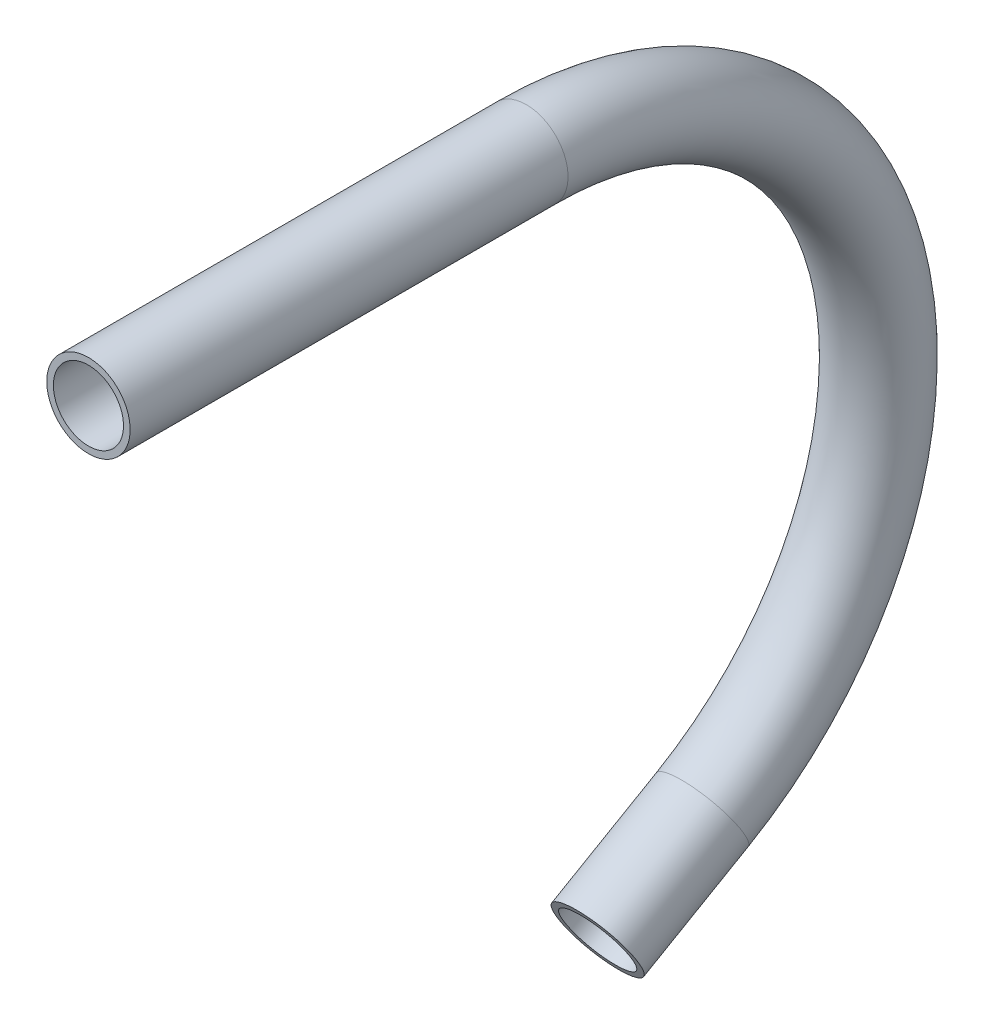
ISO-10303-21;
HEADER;
FILE_DESCRIPTION(('STEP AP214'),'2;1');
FILE_NAME('part.step','',(''),(''),'','','');
FILE_SCHEMA(('AUTOMOTIVE_DESIGN { 1 0 10303 214 1 1 1 1 }'));
ENDSEC;
DATA;
#1=APPLICATION_CONTEXT('core data for automotive mechanical design processes');
#2=APPLICATION_PROTOCOL_DEFINITION('international standard','automotive_design',2000,#1);
#3=PRODUCT_CONTEXT('',#1,'mechanical');
#4=PRODUCT('Part','Part','',(#3));
#5=PRODUCT_RELATED_PRODUCT_CATEGORY('part','',(#4));
#6=PRODUCT_DEFINITION_FORMATION('','',#4);
#7=PRODUCT_DEFINITION_CONTEXT('part definition',#1,'design');
#8=PRODUCT_DEFINITION('design','',#6,#7);
#9=PRODUCT_DEFINITION_SHAPE('','',#8);
#10=(LENGTH_UNIT() NAMED_UNIT(*) SI_UNIT(.MILLI.,.METRE.));
#11=(NAMED_UNIT(*) PLANE_ANGLE_UNIT() SI_UNIT($,.RADIAN.));
#12=(NAMED_UNIT(*) SI_UNIT($,.STERADIAN.) SOLID_ANGLE_UNIT());
#13=UNCERTAINTY_MEASURE_WITH_UNIT(LENGTH_MEASURE(1.E-05),#10,'distance_accuracy_value','');
#14=(GEOMETRIC_REPRESENTATION_CONTEXT(3) GLOBAL_UNCERTAINTY_ASSIGNED_CONTEXT((#13)) GLOBAL_UNIT_ASSIGNED_CONTEXT((#10,
#11,#12)) REPRESENTATION_CONTEXT('',''));
#15=CARTESIAN_POINT('',(0.,0.,0.));
#16=DIRECTION('',(0.,0.,1.));
#17=DIRECTION('',(1.,0.,0.));
#18=AXIS2_PLACEMENT_3D('',#15,#16,#17);
#19=CARTESIAN_POINT('',(0.,-106.706575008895,-329.932581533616));
#20=DIRECTION('',(0.,-0.5,0.866025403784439));
#21=DIRECTION('',(0.,-0.866025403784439,-0.5));
#22=AXIS2_PLACEMENT_3D('',#19,#20,#21);
#23=CYLINDRICAL_SURFACE('',#22,17.25);
#24=CARTESIAN_POINT('',(0.,-106.706575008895,-329.932581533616));
#25=DIRECTION('',(0.,-0.5,0.866025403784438));
#26=DIRECTION('',(-1.,0.,0.));
#27=AXIS2_PLACEMENT_3D('',#24,#25,#26);
#28=CIRCLE('',#27,17.25);
#29=CARTESIAN_POINT('',(0.,-121.645513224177,-338.557581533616));
#30=VERTEX_POINT('',#29);
#31=EDGE_CURVE('E42',#30,#30,#28,.T.);
#32=ORIENTED_EDGE('',*,*,#31,.T.);
#33=EDGE_LOOP('',(#32));
#34=FACE_BOUND('',#33,.T.);
#35=CARTESIAN_POINT('',(0.,-131.706575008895,-286.631311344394));
#36=DIRECTION('',(0.,-0.5,0.866025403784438));
#37=DIRECTION('',(-1.,0.,0.));
#38=AXIS2_PLACEMENT_3D('',#35,#36,#37);
#39=CIRCLE('',#38,17.25);
#40=CARTESIAN_POINT('',(-17.25,-131.706575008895,-286.631311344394));
#41=VERTEX_POINT('',#40);
#42=EDGE_CURVE('E10',#41,#41,#39,.T.);
#43=ORIENTED_EDGE('',*,*,#42,.F.);
#44=EDGE_LOOP('',(#43));
#45=FACE_BOUND('',#44,.T.);
#46=ADVANCED_FACE('F32',(#34,#45),#23,.T.);
#47=CARTESIAN_POINT('',(0.,-106.706575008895,-329.932581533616));
#48=DIRECTION('',(0.,-0.5,0.866025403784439));
#49=DIRECTION('',(0.,-0.866025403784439,-0.5));
#50=AXIS2_PLACEMENT_3D('',#47,#48,#49);
#51=CYLINDRICAL_SURFACE('',#50,14.5);
#52=CARTESIAN_POINT('',(0.,-106.706575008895,-329.932581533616));
#53=DIRECTION('',(0.,-0.5,0.866025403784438));
#54=DIRECTION('',(-1.,0.,0.));
#55=AXIS2_PLACEMENT_3D('',#52,#53,#54);
#56=CIRCLE('',#55,14.5);
#57=CARTESIAN_POINT('',(0.,-119.26394336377,-337.182581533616));
#58=VERTEX_POINT('',#57);
#59=EDGE_CURVE('E46',#58,#58,#56,.T.);
#60=ORIENTED_EDGE('',*,*,#59,.F.);
#61=EDGE_LOOP('',(#60));
#62=FACE_BOUND('',#61,.T.);
#63=CARTESIAN_POINT('',(0.,-131.706575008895,-286.631311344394));
#64=DIRECTION('',(0.,-0.5,0.866025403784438));
#65=DIRECTION('',(-1.,0.,0.));
#66=AXIS2_PLACEMENT_3D('',#63,#64,#65);
#67=CIRCLE('',#66,14.5);
#68=CARTESIAN_POINT('',(-14.5,-131.706575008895,-286.631311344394));
#69=VERTEX_POINT('',#68);
#70=EDGE_CURVE('E38',#69,#69,#67,.T.);
#71=ORIENTED_EDGE('',*,*,#70,.T.);
#72=EDGE_LOOP('',(#71));
#73=FACE_BOUND('',#72,.T.);
#74=ADVANCED_FACE('F74',(#62,#73),#51,.F.);
#75=CARTESIAN_POINT('',(0.,19.3928852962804,-257.129024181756));
#76=DIRECTION('',(-1.,0.,0.));
#77=DIRECTION('',(0.,0.,1.));
#78=AXIS2_PLACEMENT_3D('',#75,#76,#77);
#79=TOROIDAL_SURFACE('',#78,145.60711470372,17.25);
#80=CARTESIAN_POINT('',(0.,165.,-257.129024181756));
#81=DIRECTION('',(0.,0.,-1.));
#82=DIRECTION('',(-1.,0.,0.));
#83=AXIS2_PLACEMENT_3D('',#80,#81,#82);
#84=CIRCLE('',#83,17.25);
#85=CARTESIAN_POINT('',(0.,182.25,-257.129024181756));
#86=VERTEX_POINT('',#85);
#87=EDGE_CURVE('E51',#86,#86,#84,.T.);
#88=CARTESIAN_POINT('',(0.,19.3928852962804,-257.129024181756));
#89=DIRECTION('',(-1.,0.,0.));
#90=DIRECTION('',(0.,0.,1.));
#91=AXIS2_PLACEMENT_3D('',#88,#89,#90);
#92=CIRCLE('',#91,162.85711470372);
#93=EDGE_CURVE('',#86,#30,#92,.T.);
#94=ORIENTED_EDGE('',*,*,#87,.T.);
#95=ORIENTED_EDGE('',*,*,#31,.F.);
#96=ORIENTED_EDGE('',*,*,#93,.T.);
#97=ORIENTED_EDGE('',*,*,#93,.F.);
#98=EDGE_LOOP('',(#94,#96,#95,#97));
#99=FACE_BOUND('',#98,.T.);
#100=ADVANCED_FACE('F70',(#99),#79,.T.);
#101=CARTESIAN_POINT('',(0.,19.3928852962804,-257.129024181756));
#102=DIRECTION('',(-1.,0.,0.));
#103=DIRECTION('',(0.,0.,1.));
#104=AXIS2_PLACEMENT_3D('',#101,#102,#103);
#105=TOROIDAL_SURFACE('',#104,145.60711470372,14.5);
#106=CARTESIAN_POINT('',(0.,165.,-257.129024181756));
#107=DIRECTION('',(0.,0.,-1.));
#108=DIRECTION('',(-1.,0.,0.));
#109=AXIS2_PLACEMENT_3D('',#106,#107,#108);
#110=CIRCLE('',#109,14.5);
#111=CARTESIAN_POINT('',(0.,179.5,-257.129024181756));
#112=VERTEX_POINT('',#111);
#113=EDGE_CURVE('E55',#112,#112,#110,.T.);
#114=CARTESIAN_POINT('',(0.,19.3928852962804,-257.129024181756));
#115=DIRECTION('',(-1.,0.,0.));
#116=DIRECTION('',(0.,0.,1.));
#117=AXIS2_PLACEMENT_3D('',#114,#115,#116);
#118=CIRCLE('',#117,160.10711470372);
#119=EDGE_CURVE('',#112,#58,#118,.T.);
#120=ORIENTED_EDGE('',*,*,#113,.F.);
#121=ORIENTED_EDGE('',*,*,#59,.T.);
#122=ORIENTED_EDGE('',*,*,#119,.T.);
#123=ORIENTED_EDGE('',*,*,#119,.F.);
#124=EDGE_LOOP('',(#120,#122,#121,#123));
#125=FACE_BOUND('',#124,.T.);
#126=ADVANCED_FACE('F67',(#125),#105,.F.);
#127=CARTESIAN_POINT('',(0.,165.,-257.129024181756));
#128=DIRECTION('',(0.,0.,1.));
#129=DIRECTION('',(0.,-1.,0.));
#130=AXIS2_PLACEMENT_3D('',#127,#128,#129);
#131=CYLINDRICAL_SURFACE('',#130,14.5);
#132=ORIENTED_EDGE('',*,*,#113,.T.);
#133=EDGE_LOOP('',(#132));
#134=FACE_BOUND('',#133,.T.);
#135=CARTESIAN_POINT('',(0.,165.,-76.));
#136=DIRECTION('',(0.,0.,-1.));
#137=DIRECTION('',(-1.,0.,0.));
#138=AXIS2_PLACEMENT_3D('',#135,#136,#137);
#139=CIRCLE('',#138,14.5);
#140=CARTESIAN_POINT('',(-14.5,165.,-76.));
#141=VERTEX_POINT('',#140);
#142=EDGE_CURVE('E56',#141,#141,#139,.T.);
#143=ORIENTED_EDGE('',*,*,#142,.F.);
#144=EDGE_LOOP('',(#143));
#145=FACE_BOUND('',#144,.T.);
#146=ADVANCED_FACE('F64',(#134,#145),#131,.F.);
#147=CARTESIAN_POINT('',(0.,165.,-257.129024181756));
#148=DIRECTION('',(0.,0.,1.));
#149=DIRECTION('',(0.,-1.,0.));
#150=AXIS2_PLACEMENT_3D('',#147,#148,#149);
#151=CYLINDRICAL_SURFACE('',#150,17.25);
#152=ORIENTED_EDGE('',*,*,#87,.F.);
#153=EDGE_LOOP('',(#152));
#154=FACE_BOUND('',#153,.T.);
#155=CARTESIAN_POINT('',(0.,165.,-76.));
#156=DIRECTION('',(0.,0.,-1.));
#157=DIRECTION('',(-1.,0.,0.));
#158=AXIS2_PLACEMENT_3D('',#155,#156,#157);
#159=CIRCLE('',#158,17.25);
#160=CARTESIAN_POINT('',(-17.25,165.,-76.));
#161=VERTEX_POINT('',#160);
#162=EDGE_CURVE('E52',#161,#161,#159,.T.);
#163=ORIENTED_EDGE('',*,*,#162,.T.);
#164=EDGE_LOOP('',(#163));
#165=FACE_BOUND('',#164,.T.);
#166=ADVANCED_FACE('F86',(#154,#165),#151,.T.);
#167=CARTESIAN_POINT('',(0.,-131.706575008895,-286.631311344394));
#168=DIRECTION('',(0.,-0.5,0.866025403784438));
#169=DIRECTION('',(-1.,0.,0.));
#170=AXIS2_PLACEMENT_3D('',#167,#168,#169);
#171=PLANE('',#170);
#172=ORIENTED_EDGE('',*,*,#70,.F.);
#173=EDGE_LOOP('',(#172));
#174=FACE_BOUND('',#173,.T.);
#175=ORIENTED_EDGE('',*,*,#42,.T.);
#176=EDGE_LOOP('',(#175));
#177=FACE_BOUND('',#176,.T.);
#178=ADVANCED_FACE('F89',(#174,#177),#171,.T.);
#179=CARTESIAN_POINT('',(0.,165.,-76.));
#180=DIRECTION('',(0.,0.,-1.));
#181=DIRECTION('',(-1.,0.,0.));
#182=AXIS2_PLACEMENT_3D('',#179,#180,#181);
#183=PLANE('',#182);
#184=ORIENTED_EDGE('',*,*,#142,.T.);
#185=EDGE_LOOP('',(#184));
#186=FACE_BOUND('',#185,.T.);
#187=ORIENTED_EDGE('',*,*,#162,.F.);
#188=EDGE_LOOP('',(#187));
#189=FACE_BOUND('',#188,.T.);
#190=ADVANCED_FACE('F91',(#186,#189),#183,.F.);
#191=CLOSED_SHELL('',(#46,#74,#100,#126,#146,#166,#178,#190));
#192=MANIFOLD_SOLID_BREP('B2',#191);
#193=ADVANCED_BREP_SHAPE_REPRESENTATION('',(#18,#192),#14);
#194=SHAPE_DEFINITION_REPRESENTATION(#9,#193);
ENDSEC;
END-ISO-10303-21;
